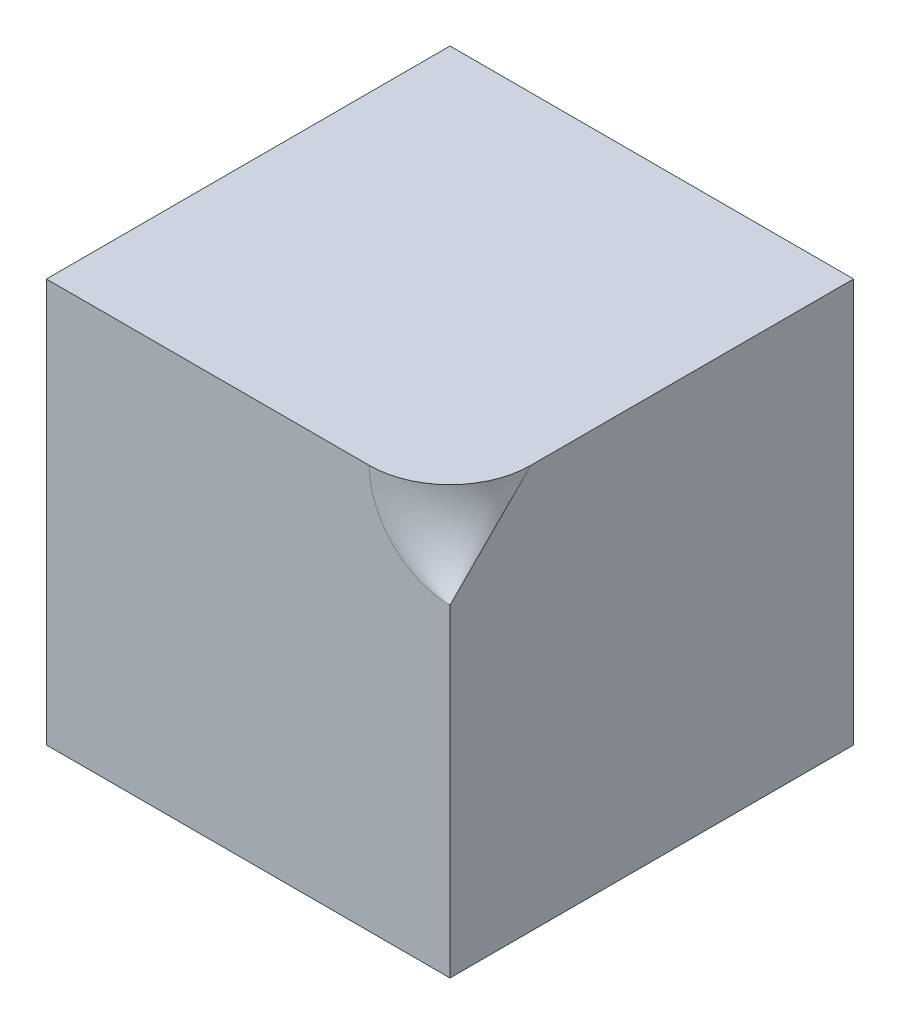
ISO-10303-21;
HEADER;
FILE_DESCRIPTION(('STEP AP214'),'2;1');
FILE_NAME('part.step','',(''),(''),'','','');
FILE_SCHEMA(('AUTOMOTIVE_DESIGN { 1 0 10303 214 1 1 1 1 }'));
ENDSEC;
DATA;
#1=APPLICATION_CONTEXT('core data for automotive mechanical design processes');
#2=APPLICATION_PROTOCOL_DEFINITION('international standard','automotive_design',2000,#1);
#3=PRODUCT_CONTEXT('',#1,'mechanical');
#4=PRODUCT('Part','Part','',(#3));
#5=PRODUCT_RELATED_PRODUCT_CATEGORY('part','',(#4));
#6=PRODUCT_DEFINITION_FORMATION('','',#4);
#7=PRODUCT_DEFINITION_CONTEXT('part definition',#1,'design');
#8=PRODUCT_DEFINITION('design','',#6,#7);
#9=PRODUCT_DEFINITION_SHAPE('','',#8);
#10=(LENGTH_UNIT() NAMED_UNIT(*) SI_UNIT(.MILLI.,.METRE.));
#11=(NAMED_UNIT(*) PLANE_ANGLE_UNIT() SI_UNIT($,.RADIAN.));
#12=(NAMED_UNIT(*) SI_UNIT($,.STERADIAN.) SOLID_ANGLE_UNIT());
#13=UNCERTAINTY_MEASURE_WITH_UNIT(LENGTH_MEASURE(1.E-05),#10,'distance_accuracy_value','');
#14=(GEOMETRIC_REPRESENTATION_CONTEXT(3) GLOBAL_UNCERTAINTY_ASSIGNED_CONTEXT((#13)) GLOBAL_UNIT_ASSIGNED_CONTEXT((#10,
#11,#12)) REPRESENTATION_CONTEXT('',''));
#15=CARTESIAN_POINT('',(0.,0.,0.));
#16=DIRECTION('',(0.,0.,1.));
#17=DIRECTION('',(1.,0.,0.));
#18=AXIS2_PLACEMENT_3D('',#15,#16,#17);
#19=CARTESIAN_POINT('',(50.,-50.,100.));
#20=DIRECTION('',(-1.,0.,0.));
#21=DIRECTION('',(0.,0.,1.));
#22=AXIS2_PLACEMENT_3D('',#19,#20,#21);
#23=PLANE('',#22);
#24=DIRECTION('',(0.,-0.707106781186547,0.707106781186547));
#25=VECTOR('',#24,1.);
#26=CARTESIAN_POINT('',(50.,40.,90.));
#27=LINE('',#26,#25);
#28=CARTESIAN_POINT('',(50.,50.,80.));
#29=VERTEX_POINT('',#28);
#30=CARTESIAN_POINT('',(50.0000000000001,30.,100.));
#31=VERTEX_POINT('',#30);
#32=EDGE_CURVE('E77',#29,#31,#27,.T.);
#33=ORIENTED_EDGE('',*,*,#32,.T.);
#34=DIRECTION('',(0.,1.,0.));
#35=VECTOR('',#34,1.);
#36=CARTESIAN_POINT('',(50.,-50.,100.));
#37=LINE('',#36,#35);
#38=CARTESIAN_POINT('',(50.,-50.,100.));
#39=VERTEX_POINT('',#38);
#40=EDGE_CURVE('E63',#39,#31,#37,.T.);
#41=ORIENTED_EDGE('',*,*,#40,.F.);
#42=DIRECTION('',(0.,0.,-1.));
#43=VECTOR('',#42,1.);
#44=CARTESIAN_POINT('',(50.,-50.,100.));
#45=LINE('',#44,#43);
#46=CARTESIAN_POINT('',(50.,-50.,0.));
#47=VERTEX_POINT('',#46);
#48=EDGE_CURVE('E142',#39,#47,#45,.T.);
#49=ORIENTED_EDGE('',*,*,#48,.T.);
#50=DIRECTION('',(0.,1.,0.));
#51=VECTOR('',#50,1.);
#52=CARTESIAN_POINT('',(50.,-50.,0.));
#53=LINE('',#52,#51);
#54=CARTESIAN_POINT('',(50.,50.,0.));
#55=VERTEX_POINT('',#54);
#56=EDGE_CURVE('E145',#47,#55,#53,.T.);
#57=ORIENTED_EDGE('',*,*,#56,.T.);
#58=DIRECTION('',(0.,0.,-1.));
#59=VECTOR('',#58,1.);
#60=CARTESIAN_POINT('',(50.,50.,100.));
#61=LINE('',#60,#59);
#62=EDGE_CURVE('E137',#29,#55,#61,.T.);
#63=ORIENTED_EDGE('',*,*,#62,.F.);
#64=EDGE_LOOP('',(#33,#41,#49,#57,#63));
#65=FACE_BOUND('',#64,.T.);
#66=ADVANCED_FACE('F59',(#65),#23,.F.);
#67=CARTESIAN_POINT('',(-50.,50.,100.));
#68=DIRECTION('',(0.,-1.,0.));
#69=DIRECTION('',(0.,0.,-1.));
#70=AXIS2_PLACEMENT_3D('',#67,#68,#69);
#71=PLANE('',#70);
#72=CARTESIAN_POINT('',(30.,50.,80.));
#73=DIRECTION('',(0.,-1.,0.));
#74=DIRECTION('',(0.,0.,1.));
#75=AXIS2_PLACEMENT_3D('',#72,#73,#74);
#76=CIRCLE('',#75,20.);
#77=CARTESIAN_POINT('',(30.,50.,100.));
#78=VERTEX_POINT('',#77);
#79=EDGE_CURVE('E13',#29,#78,#76,.T.);
#80=ORIENTED_EDGE('',*,*,#79,.F.);
#81=ORIENTED_EDGE('',*,*,#62,.T.);
#82=DIRECTION('',(-1.,0.,0.));
#83=VECTOR('',#82,1.);
#84=CARTESIAN_POINT('',(-50.,50.,0.));
#85=LINE('',#84,#83);
#86=CARTESIAN_POINT('',(-50.,50.,0.));
#87=VERTEX_POINT('',#86);
#88=EDGE_CURVE('E117',#55,#87,#85,.T.);
#89=ORIENTED_EDGE('',*,*,#88,.T.);
#90=DIRECTION('',(0.,0.,-1.));
#91=VECTOR('',#90,1.);
#92=CARTESIAN_POINT('',(-50.,50.,100.));
#93=LINE('',#92,#91);
#94=CARTESIAN_POINT('',(-50.,50.,100.));
#95=VERTEX_POINT('',#94);
#96=EDGE_CURVE('E114',#95,#87,#93,.T.);
#97=ORIENTED_EDGE('',*,*,#96,.F.);
#98=DIRECTION('',(-1.,0.,0.));
#99=VECTOR('',#98,1.);
#100=CARTESIAN_POINT('',(-50.,50.,100.));
#101=LINE('',#100,#99);
#102=EDGE_CURVE('E103',#78,#95,#101,.T.);
#103=ORIENTED_EDGE('',*,*,#102,.F.);
#104=EDGE_LOOP('',(#80,#81,#89,#97,#103));
#105=FACE_BOUND('',#104,.T.);
#106=ADVANCED_FACE('F115',(#105),#71,.F.);
#107=CARTESIAN_POINT('',(50.,50.,100.));
#108=DIRECTION('',(0.,0.,-1.));
#109=DIRECTION('',(-1.,0.,0.));
#110=AXIS2_PLACEMENT_3D('',#107,#108,#109);
#111=PLANE('',#110);
#112=ORIENTED_EDGE('',*,*,#40,.T.);
#113=CARTESIAN_POINT('',(30.,50.,100.));
#114=CARTESIAN_POINT('',(30.,49.5584679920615,100.));
#115=CARTESIAN_POINT('',(30.0286774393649,48.6820490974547,100.));
#116=CARTESIAN_POINT('',(30.1550820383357,47.3899999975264,100.));
#117=CARTESIAN_POINT('',(30.3622311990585,46.1231740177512,100.));
#118=CARTESIAN_POINT('',(30.6474810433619,44.8842150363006,100.));
#119=CARTESIAN_POINT('',(31.0081876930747,43.675766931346,100.));
#120=CARTESIAN_POINT('',(31.4417072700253,42.5004735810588,100.));
#121=CARTESIAN_POINT('',(31.9453958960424,41.3609788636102,100.));
#122=CARTESIAN_POINT('',(32.5166096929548,40.2599266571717,100.));
#123=CARTESIAN_POINT('',(33.1527047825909,39.1999608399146,100.));
#124=CARTESIAN_POINT('',(33.8510372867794,38.1837252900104,100.));
#125=CARTESIAN_POINT('',(34.608963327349,37.2138638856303,100.));
#126=CARTESIAN_POINT('',(35.4238390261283,36.2930205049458,100.));
#127=CARTESIAN_POINT('',(36.2930205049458,35.4238390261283,100.));
#128=CARTESIAN_POINT('',(37.2138638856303,34.608963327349,100.));
#129=CARTESIAN_POINT('',(38.1837252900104,33.8510372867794,100.));
#130=CARTESIAN_POINT('',(39.1999608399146,33.1527047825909,100.));
#131=CARTESIAN_POINT('',(40.2599266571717,32.5166096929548,100.));
#132=CARTESIAN_POINT('',(41.3609788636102,31.9453958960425,100.));
#133=CARTESIAN_POINT('',(42.5004735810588,31.4417072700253,100.));
#134=CARTESIAN_POINT('',(43.675766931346,31.0081876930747,100.));
#135=CARTESIAN_POINT('',(44.8842150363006,30.6474810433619,100.));
#136=CARTESIAN_POINT('',(46.1231740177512,30.3622311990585,100.));
#137=CARTESIAN_POINT('',(47.3899999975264,30.1550820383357,100.));
#138=CARTESIAN_POINT('',(48.6820490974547,30.0286774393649,100.));
#139=CARTESIAN_POINT('',(49.5584679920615,30.,100.));
#140=CARTESIAN_POINT('',(50.,30.,100.));
#141=B_SPLINE_CURVE_WITH_KNOTS('',3,(#113,#114,#115,#116,#117,#118,#119,#120,#121,#122,#123,
#124,#125,#126,#127,#128,#129,#130,#131,#132,#133,#134,#135,#136,#137,#138,#139,#140),
.UNSPECIFIED.,.F.,.F.,(4,1,1,1,1,1,1,1,1,1,1,1,1,1,1,1,1,1,1,1,1,1,1,1,1,4),(0.,0.04,0.08,0.12,
0.16,0.2,0.24,0.28,0.32,0.36,0.4,0.44,0.48,0.52,0.56,0.6,0.64,0.68,0.72,0.76,0.8,0.84,0.88,0.92,
0.96,1.),.UNSPECIFIED.);
#142=EDGE_CURVE('E109',#31,#78,#141,.F.);
#143=ORIENTED_EDGE('',*,*,#142,.T.);
#144=ORIENTED_EDGE('',*,*,#102,.T.);
#145=DIRECTION('',(0.,-1.,0.));
#146=VECTOR('',#145,1.);
#147=CARTESIAN_POINT('',(-50.,-50.,100.));
#148=LINE('',#147,#146);
#149=CARTESIAN_POINT('',(-50.,-50.,100.));
#150=VERTEX_POINT('',#149);
#151=EDGE_CURVE('E107',#95,#150,#148,.T.);
#152=ORIENTED_EDGE('',*,*,#151,.T.);
#153=DIRECTION('',(1.,0.,0.));
#154=VECTOR('',#153,1.);
#155=CARTESIAN_POINT('',(-50.,-50.,100.));
#156=LINE('',#155,#154);
#157=EDGE_CURVE('E126',#150,#39,#156,.T.);
#158=ORIENTED_EDGE('',*,*,#157,.T.);
#159=EDGE_LOOP('',(#112,#143,#144,#152,#158));
#160=FACE_BOUND('',#159,.T.);
#161=ADVANCED_FACE('F61',(#160),#111,.F.);
#162=CARTESIAN_POINT('',(-50.,-50.,100.));
#163=DIRECTION('',(1.,0.,0.));
#164=DIRECTION('',(0.,0.,-1.));
#165=AXIS2_PLACEMENT_3D('',#162,#163,#164);
#166=PLANE('',#165);
#167=DIRECTION('',(0.,-1.,0.));
#168=VECTOR('',#167,1.);
#169=CARTESIAN_POINT('',(-50.,-50.,0.));
#170=LINE('',#169,#168);
#171=CARTESIAN_POINT('',(-50.,-50.,0.));
#172=VERTEX_POINT('',#171);
#173=EDGE_CURVE('E121',#87,#172,#170,.T.);
#174=ORIENTED_EDGE('',*,*,#173,.T.);
#175=DIRECTION('',(0.,0.,-1.));
#176=VECTOR('',#175,1.);
#177=CARTESIAN_POINT('',(-50.,-50.,100.));
#178=LINE('',#177,#176);
#179=EDGE_CURVE('E69',#150,#172,#178,.T.);
#180=ORIENTED_EDGE('',*,*,#179,.F.);
#181=ORIENTED_EDGE('',*,*,#151,.F.);
#182=ORIENTED_EDGE('',*,*,#96,.T.);
#183=EDGE_LOOP('',(#174,#180,#181,#182));
#184=FACE_BOUND('',#183,.T.);
#185=ADVANCED_FACE('F123',(#184),#166,.F.);
#186=CARTESIAN_POINT('',(-50.,-50.,100.));
#187=DIRECTION('',(0.,1.,0.));
#188=DIRECTION('',(0.,0.,1.));
#189=AXIS2_PLACEMENT_3D('',#186,#187,#188);
#190=PLANE('',#189);
#191=DIRECTION('',(1.,0.,0.));
#192=VECTOR('',#191,1.);
#193=CARTESIAN_POINT('',(-50.,-50.,0.));
#194=LINE('',#193,#192);
#195=EDGE_CURVE('E120',#172,#47,#194,.T.);
#196=ORIENTED_EDGE('',*,*,#195,.T.);
#197=ORIENTED_EDGE('',*,*,#48,.F.);
#198=ORIENTED_EDGE('',*,*,#157,.F.);
#199=ORIENTED_EDGE('',*,*,#179,.T.);
#200=EDGE_LOOP('',(#196,#197,#198,#199));
#201=FACE_BOUND('',#200,.T.);
#202=ADVANCED_FACE('F155',(#201),#190,.F.);
#203=CARTESIAN_POINT('',(50.,50.,0.));
#204=DIRECTION('',(0.,0.,-1.));
#205=DIRECTION('',(-1.,0.,0.));
#206=AXIS2_PLACEMENT_3D('',#203,#204,#205);
#207=PLANE('',#206);
#208=ORIENTED_EDGE('',*,*,#56,.F.);
#209=ORIENTED_EDGE('',*,*,#195,.F.);
#210=ORIENTED_EDGE('',*,*,#173,.F.);
#211=ORIENTED_EDGE('',*,*,#88,.F.);
#212=EDGE_LOOP('',(#208,#209,#210,#211));
#213=FACE_BOUND('',#212,.T.);
#214=ADVANCED_FACE('F152',(#213),#207,.T.);
#215=CARTESIAN_POINT('',(30.,50.,100.));
#216=CARTESIAN_POINT('',(30.,49.5584679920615,100.));
#217=CARTESIAN_POINT('',(30.0286774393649,48.6820490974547,100.));
#218=CARTESIAN_POINT('',(30.1550820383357,47.3899999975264,100.));
#219=CARTESIAN_POINT('',(30.3622311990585,46.1231740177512,100.));
#220=CARTESIAN_POINT('',(30.6474810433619,44.8842150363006,100.));
#221=CARTESIAN_POINT('',(31.0081876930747,43.675766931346,100.));
#222=CARTESIAN_POINT('',(31.4417072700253,42.5004735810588,100.));
#223=CARTESIAN_POINT('',(31.9453958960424,41.3609788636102,100.));
#224=CARTESIAN_POINT('',(32.5166096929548,40.2599266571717,100.));
#225=CARTESIAN_POINT('',(33.1527047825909,39.1999608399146,100.));
#226=CARTESIAN_POINT('',(33.8510372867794,38.1837252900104,100.));
#227=CARTESIAN_POINT('',(34.608963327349,37.2138638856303,100.));
#228=CARTESIAN_POINT('',(35.4238390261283,36.2930205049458,100.));
#229=CARTESIAN_POINT('',(36.2930205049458,35.4238390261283,100.));
#230=CARTESIAN_POINT('',(37.2138638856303,34.608963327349,100.));
#231=CARTESIAN_POINT('',(38.1837252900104,33.8510372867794,100.));
#232=CARTESIAN_POINT('',(39.1999608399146,33.1527047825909,100.));
#233=CARTESIAN_POINT('',(40.2599266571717,32.5166096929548,100.));
#234=CARTESIAN_POINT('',(41.3609788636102,31.9453958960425,100.));
#235=CARTESIAN_POINT('',(42.5004735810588,31.4417072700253,100.));
#236=CARTESIAN_POINT('',(43.675766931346,31.0081876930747,100.));
#237=CARTESIAN_POINT('',(44.8842150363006,30.6474810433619,100.));
#238=CARTESIAN_POINT('',(46.1231740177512,30.3622311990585,100.));
#239=CARTESIAN_POINT('',(47.3899999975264,30.1550820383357,100.));
#240=CARTESIAN_POINT('',(48.6820490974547,30.0286774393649,100.));
#241=CARTESIAN_POINT('',(49.5584679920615,30.,100.));
#242=CARTESIAN_POINT('',(50.,30.,100.));
#243=CARTESIAN_POINT('',(41.038300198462,50.,100.));
#244=CARTESIAN_POINT('',(40.9800117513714,49.6167564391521,100.));
#245=CARTESIAN_POINT('',(40.8825531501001,48.8546993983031,100.));
#246=CARTESIAN_POINT('',(40.7919575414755,47.7266666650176,100.));
#247=CARTESIAN_POINT('',(40.7551916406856,46.6154493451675,100.));
#248=CARTESIAN_POINT('',(40.7704928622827,45.5228100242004,100.));
#249=CARTESIAN_POINT('',(40.8360986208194,44.450511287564,100.));
#250=CARTESIAN_POINT('',(40.950246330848,43.4003157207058,100.));
#251=CARTESIAN_POINT('',(41.1111734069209,42.3739859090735,100.));
#252=CARTESIAN_POINT('',(41.3171172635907,41.3732844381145,100.));
#253=CARTESIAN_POINT('',(41.5663153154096,40.3999738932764,100.));
#254=CARTESIAN_POINT('',(41.8570049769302,39.4558168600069,100.));
#255=CARTESIAN_POINT('',(42.1874236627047,38.5425759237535,100.));
#256=CARTESIAN_POINT('',(42.5558087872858,37.6620136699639,100.));
#257=CARTESIAN_POINT('',(42.9603977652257,36.8158926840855,100.));
#258=CARTESIAN_POINT('',(43.3994280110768,36.005975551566,100.));
#259=CARTESIAN_POINT('',(43.8711369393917,35.234024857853,100.));
#260=CARTESIAN_POINT('',(44.3737619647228,34.5018031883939,100.));
#261=CARTESIAN_POINT('',(44.9055405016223,33.8110731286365,100.));
#262=CARTESIAN_POINT('',(45.4647099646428,33.1635972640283,100.));
#263=CARTESIAN_POINT('',(46.0495077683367,32.5611381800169,100.));
#264=CARTESIAN_POINT('',(46.6581713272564,32.0054584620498,100.));
#265=CARTESIAN_POINT('',(47.2889380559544,31.4983206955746,100.));
#266=CARTESIAN_POINT('',(47.9400453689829,31.041487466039,100.));
#267=CARTESIAN_POINT('',(48.6097306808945,30.6367213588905,100.));
#268=CARTESIAN_POINT('',(49.2962314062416,30.2857849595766,100.));
#269=CARTESIAN_POINT('',(49.7639337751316,30.0888888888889,100.));
#270=CARTESIAN_POINT('',(50.,30.,100.));
#271=CARTESIAN_POINT('',(50.,50.,91.038300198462));
#272=CARTESIAN_POINT('',(49.9111111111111,49.6750448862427,91.1577895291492));
#273=CARTESIAN_POINT('',(49.7428924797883,49.0273496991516,91.3967681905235));
#274=CARTESIAN_POINT('',(49.5183606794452,48.0633333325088,91.755236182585));
#275=CARTESIAN_POINT('',(49.3207437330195,47.1077246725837,92.1137041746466));
#276=CARTESIAN_POINT('',(49.1491603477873,46.1614050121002,92.4721721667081));
#277=CARTESIAN_POINT('',(49.0027292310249,45.225255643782,92.8306401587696));
#278=CARTESIAN_POINT('',(48.8805690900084,44.3001578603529,93.1891081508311));
#279=CARTESIAN_POINT('',(48.7817986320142,43.3869929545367,93.5475761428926));
#280=CARTESIAN_POINT('',(48.7055365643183,42.4866422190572,93.9060441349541));
#281=CARTESIAN_POINT('',(48.650901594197,41.5999869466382,94.2645121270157));
#282=CARTESIAN_POINT('',(48.6170124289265,40.7279084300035,94.6229801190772));
#283=CARTESIAN_POINT('',(48.602987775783,39.8712879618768,94.9814481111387));
#284=CARTESIAN_POINT('',(48.6079463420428,39.0310068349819,95.3399161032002));
#285=CARTESIAN_POINT('',(48.631006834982,38.2079463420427,95.6983840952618));
#286=CARTESIAN_POINT('',(48.6712879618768,37.402987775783,96.0568520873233));
#287=CARTESIAN_POINT('',(48.7279084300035,36.6170124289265,96.4153200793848));
#288=CARTESIAN_POINT('',(48.7999869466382,35.850901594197,96.7737880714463));
#289=CARTESIAN_POINT('',(48.8866422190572,35.1055365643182,97.1322560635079));
#290=CARTESIAN_POINT('',(48.9869929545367,34.3817986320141,97.4907240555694));
#291=CARTESIAN_POINT('',(49.1001578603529,33.6805690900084,97.8491920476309));
#292=CARTESIAN_POINT('',(49.225255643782,33.0027292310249,98.2076600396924));
#293=CARTESIAN_POINT('',(49.3614050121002,32.3491603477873,98.5661280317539));
#294=CARTESIAN_POINT('',(49.5077246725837,31.7207437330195,98.9245960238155));
#295=CARTESIAN_POINT('',(49.6633333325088,31.1183606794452,99.283064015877));
#296=CARTESIAN_POINT('',(49.8273496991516,30.5428924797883,99.6415320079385));
#297=CARTESIAN_POINT('',(49.9417115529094,30.1777777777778,99.8805106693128));
#298=CARTESIAN_POINT('',(50.,30.,100.));
#299=CARTESIAN_POINT('',(50.,50.,80.));
#300=CARTESIAN_POINT('',(50.,49.7333333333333,80.2666666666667));
#301=CARTESIAN_POINT('',(50.,49.2,80.8));
#302=CARTESIAN_POINT('',(50.,48.4,81.6));
#303=CARTESIAN_POINT('',(50.,47.6,82.4));
#304=CARTESIAN_POINT('',(50.,46.8,83.2));
#305=CARTESIAN_POINT('',(50.,46.,84.));
#306=CARTESIAN_POINT('',(50.,45.2,84.8));
#307=CARTESIAN_POINT('',(50.,44.4,85.6));
#308=CARTESIAN_POINT('',(50.,43.6,86.4));
#309=CARTESIAN_POINT('',(50.,42.8,87.2));
#310=CARTESIAN_POINT('',(50.,42.,88.));
#311=CARTESIAN_POINT('',(50.,41.2,88.8));
#312=CARTESIAN_POINT('',(50.,40.4,89.6));
#313=CARTESIAN_POINT('',(50.,39.6,90.4));
#314=CARTESIAN_POINT('',(50.,38.8,91.2));
#315=CARTESIAN_POINT('',(50.,38.,92.));
#316=CARTESIAN_POINT('',(50.,37.2,92.8000000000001));
#317=CARTESIAN_POINT('',(50.,36.4,93.6000000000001));
#318=CARTESIAN_POINT('',(50.,35.6,94.4));
#319=CARTESIAN_POINT('',(50.,34.8,95.2));
#320=CARTESIAN_POINT('',(50.,34.,96.));
#321=CARTESIAN_POINT('',(50.,33.2,96.8000000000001));
#322=CARTESIAN_POINT('',(50.,32.4,97.6000000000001));
#323=CARTESIAN_POINT('',(50.,31.6,98.4));
#324=CARTESIAN_POINT('',(50.,30.8,99.2));
#325=CARTESIAN_POINT('',(50.,30.2666666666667,99.7333333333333));
#326=CARTESIAN_POINT('',(50.,30.,100.));
#327=B_SPLINE_SURFACE_WITH_KNOTS('',3,3,((#215,#216,#217,#218,#219,#220,#221,#222,#223,#224,
#225,#226,#227,#228,#229,#230,#231,#232,#233,#234,#235,#236,#237,#238,#239,#240,#241,#242),
(#243,#244,#245,#246,#247,#248,#249,#250,#251,#252,#253,#254,#255,#256,#257,#258,#259,#260,#261,
#262,#263,#264,#265,#266,#267,#268,#269,#270),(#271,#272,#273,#274,#275,#276,#277,#278,#279,
#280,#281,#282,#283,#284,#285,#286,#287,#288,#289,#290,#291,#292,#293,#294,#295,#296,#297,#298),
(#299,#300,#301,#302,#303,#304,#305,#306,#307,#308,#309,#310,#311,#312,#313,#314,#315,#316,#317,
#318,#319,#320,#321,#322,#323,#324,#325,#326)),.UNSPECIFIED.,.F.,.F.,.F.,(4,4),(4,1,1,1,1,1,1,1,
1,1,1,1,1,1,1,1,1,1,1,1,1,1,1,1,1,4),(0.,1.),(0.,0.04,0.08,0.12,0.16,0.2,0.24,0.28,0.32,0.36,
0.4,0.44,0.48,0.52,0.56,0.6,0.64,0.68,0.72,0.76,0.8,0.84,0.88,0.92,0.96,1.),.UNSPECIFIED.);
#328=ORIENTED_EDGE('',*,*,#79,.T.);
#329=ORIENTED_EDGE('',*,*,#142,.F.);
#330=ORIENTED_EDGE('',*,*,#32,.F.);
#331=EDGE_LOOP('',(#328,#329,#330));
#332=FACE_BOUND('',#331,.T.);
#333=ADVANCED_FACE('F171',(#332),#327,.F.);
#334=CLOSED_SHELL('',(#66,#106,#161,#185,#202,#214,#333));
#335=MANIFOLD_SOLID_BREP('B2',#334);
#336=ADVANCED_BREP_SHAPE_REPRESENTATION('',(#18,#335),#14);
#337=SHAPE_DEFINITION_REPRESENTATION(#9,#336);
ENDSEC;
END-ISO-10303-21;
